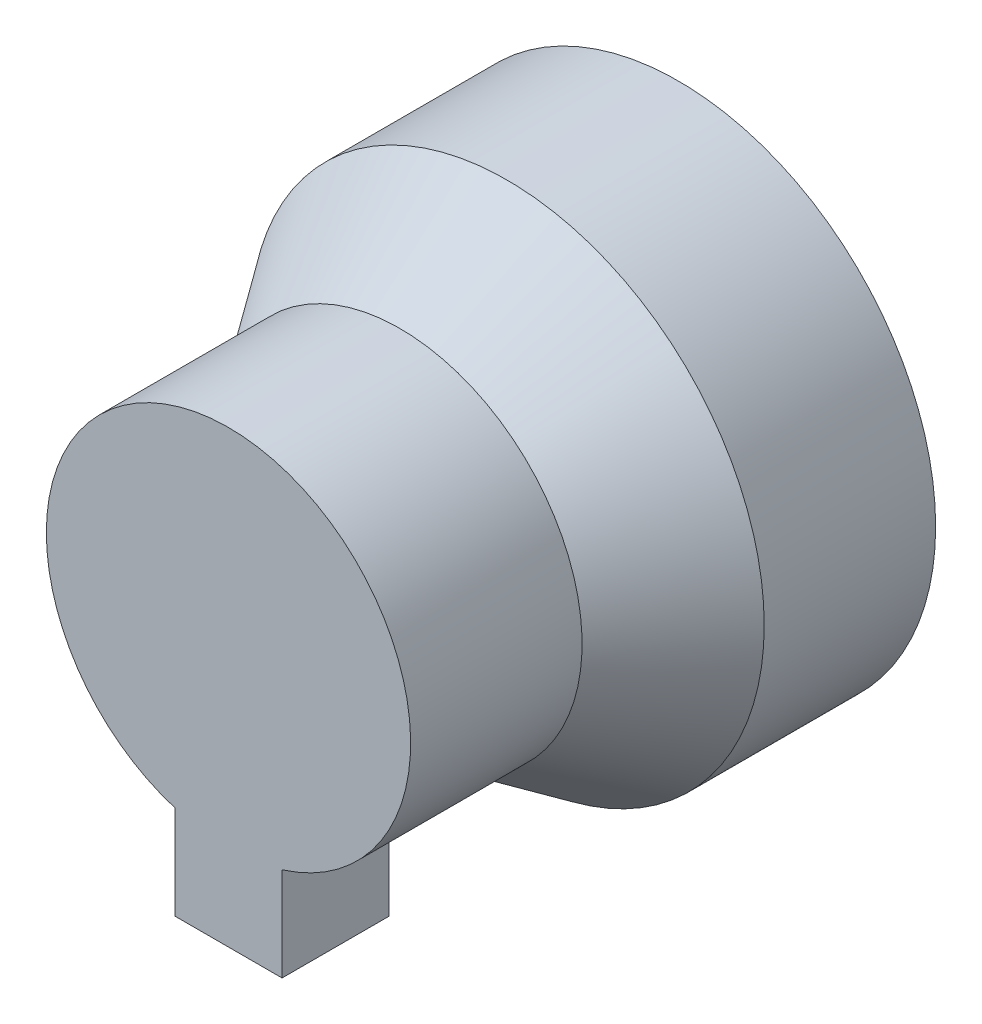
ISO-10303-21;
HEADER;
FILE_DESCRIPTION(('STEP AP214'),'2;1');
FILE_NAME('part.step','',(''),(''),'','','');
FILE_SCHEMA(('AUTOMOTIVE_DESIGN { 1 0 10303 214 1 1 1 1 }'));
ENDSEC;
DATA;
#1=APPLICATION_CONTEXT('core data for automotive mechanical design processes');
#2=APPLICATION_PROTOCOL_DEFINITION('international standard','automotive_design',2000,#1);
#3=PRODUCT_CONTEXT('',#1,'mechanical');
#4=PRODUCT('Part','Part','',(#3));
#5=PRODUCT_RELATED_PRODUCT_CATEGORY('part','',(#4));
#6=PRODUCT_DEFINITION_FORMATION('','',#4);
#7=PRODUCT_DEFINITION_CONTEXT('part definition',#1,'design');
#8=PRODUCT_DEFINITION('design','',#6,#7);
#9=PRODUCT_DEFINITION_SHAPE('','',#8);
#10=(LENGTH_UNIT() NAMED_UNIT(*) SI_UNIT(.MILLI.,.METRE.));
#11=(NAMED_UNIT(*) PLANE_ANGLE_UNIT() SI_UNIT($,.RADIAN.));
#12=(NAMED_UNIT(*) SI_UNIT($,.STERADIAN.) SOLID_ANGLE_UNIT());
#13=UNCERTAINTY_MEASURE_WITH_UNIT(LENGTH_MEASURE(1.E-05),#10,'distance_accuracy_value','');
#14=(GEOMETRIC_REPRESENTATION_CONTEXT(3) GLOBAL_UNCERTAINTY_ASSIGNED_CONTEXT((#13)) GLOBAL_UNIT_ASSIGNED_CONTEXT((#10,
#11,#12)) REPRESENTATION_CONTEXT('',''));
#15=CARTESIAN_POINT('',(0.,0.,0.));
#16=DIRECTION('',(0.,0.,1.));
#17=DIRECTION('',(1.,0.,0.));
#18=AXIS2_PLACEMENT_3D('',#15,#16,#17);
#19=CARTESIAN_POINT('',(0.,0.,0.));
#20=DIRECTION('',(0.,0.,-1.));
#21=DIRECTION('',(-1.,0.,0.));
#22=AXIS2_PLACEMENT_3D('',#19,#20,#21);
#23=CYLINDRICAL_SURFACE('',#22,8.5);
#24=CARTESIAN_POINT('',(0.,0.,13.));
#25=DIRECTION('',(0.,0.,-1.));
#26=DIRECTION('',(-1.,0.,0.));
#27=AXIS2_PLACEMENT_3D('',#24,#25,#26);
#28=CIRCLE('',#27,8.5);
#29=CARTESIAN_POINT('',(-8.5,0.,13.));
#30=VERTEX_POINT('',#29);
#31=EDGE_CURVE('E167',#30,#30,#28,.T.);
#32=ORIENTED_EDGE('',*,*,#31,.F.);
#33=EDGE_LOOP('',(#32));
#34=FACE_BOUND('',#33,.T.);
#35=CARTESIAN_POINT('',(0.,0.,16.));
#36=DIRECTION('',(0.,0.,1.));
#37=DIRECTION('',(1.,0.,0.));
#38=AXIS2_PLACEMENT_3D('',#35,#36,#37);
#39=CIRCLE('',#38,8.5);
#40=CARTESIAN_POINT('',(2.5,-8.12403840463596,16.));
#41=VERTEX_POINT('',#40);
#42=CARTESIAN_POINT('',(-2.5,-8.12403840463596,16.));
#43=VERTEX_POINT('',#42);
#44=EDGE_CURVE('E42',#41,#43,#39,.F.);
#45=ORIENTED_EDGE('',*,*,#44,.T.);
#46=DIRECTION('',(0.,0.,-1.));
#47=VECTOR('',#46,1.);
#48=CARTESIAN_POINT('',(-2.5,-8.12403840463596,0.));
#49=LINE('',#48,#47);
#50=CARTESIAN_POINT('',(-2.5,-8.12403840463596,21.));
#51=VERTEX_POINT('',#50);
#52=EDGE_CURVE('E11',#43,#51,#49,.F.);
#53=ORIENTED_EDGE('',*,*,#52,.T.);
#54=CARTESIAN_POINT('',(0.,0.,21.));
#55=DIRECTION('',(0.,0.,-1.));
#56=DIRECTION('',(-1.,0.,0.));
#57=AXIS2_PLACEMENT_3D('',#54,#55,#56);
#58=CIRCLE('',#57,8.5);
#59=CARTESIAN_POINT('',(2.5,-8.12403840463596,21.));
#60=VERTEX_POINT('',#59);
#61=EDGE_CURVE('E170',#51,#60,#58,.T.);
#62=ORIENTED_EDGE('',*,*,#61,.T.);
#63=DIRECTION('',(0.,0.,-1.));
#64=VECTOR('',#63,1.);
#65=CARTESIAN_POINT('',(2.5,-8.12403840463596,0.));
#66=LINE('',#65,#64);
#67=EDGE_CURVE('E172',#41,#60,#66,.F.);
#68=ORIENTED_EDGE('',*,*,#67,.F.);
#69=EDGE_LOOP('',(#45,#53,#62,#68));
#70=FACE_BOUND('',#69,.T.);
#71=ADVANCED_FACE('F34',(#34,#70),#23,.T.);
#72=CARTESIAN_POINT('',(0.,0.,21.));
#73=DIRECTION('',(0.,0.,1.));
#74=DIRECTION('',(1.,0.,0.));
#75=AXIS2_PLACEMENT_3D('',#72,#73,#74);
#76=PLANE('',#75);
#77=ORIENTED_EDGE('',*,*,#61,.F.);
#78=DIRECTION('',(0.,-1.,0.));
#79=VECTOR('',#78,1.);
#80=CARTESIAN_POINT('',(-2.5,-2.5,21.));
#81=LINE('',#80,#79);
#82=CARTESIAN_POINT('',(-2.5,-12.5,21.));
#83=VERTEX_POINT('',#82);
#84=EDGE_CURVE('E157',#51,#83,#81,.T.);
#85=ORIENTED_EDGE('',*,*,#84,.T.);
#86=DIRECTION('',(-1.,0.,0.));
#87=VECTOR('',#86,1.);
#88=CARTESIAN_POINT('',(2.5,-12.5,21.));
#89=LINE('',#88,#87);
#90=CARTESIAN_POINT('',(2.5,-12.5,21.));
#91=VERTEX_POINT('',#90);
#92=EDGE_CURVE('E147',#91,#83,#89,.T.);
#93=ORIENTED_EDGE('',*,*,#92,.F.);
#94=DIRECTION('',(0.,-1.,0.));
#95=VECTOR('',#94,1.);
#96=CARTESIAN_POINT('',(2.5,-2.5,21.));
#97=LINE('',#96,#95);
#98=EDGE_CURVE('E155',#60,#91,#97,.T.);
#99=ORIENTED_EDGE('',*,*,#98,.F.);
#100=EDGE_LOOP('',(#77,#85,#93,#99));
#101=FACE_BOUND('',#100,.T.);
#102=ADVANCED_FACE('F36',(#101),#76,.T.);
#103=CARTESIAN_POINT('',(0.,0.,8.));
#104=DIRECTION('',(0.,0.,-1.));
#105=DIRECTION('',(-1.,0.,0.));
#106=AXIS2_PLACEMENT_3D('',#103,#104,#105);
#107=CONICAL_SURFACE('',#106,12.,0.610725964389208);
#108=ORIENTED_EDGE('',*,*,#31,.T.);
#109=EDGE_LOOP('',(#108));
#110=FACE_BOUND('',#109,.T.);
#111=CARTESIAN_POINT('',(0.,0.,8.));
#112=DIRECTION('',(0.,0.,-1.));
#113=DIRECTION('',(-1.,0.,0.));
#114=AXIS2_PLACEMENT_3D('',#111,#112,#113);
#115=CIRCLE('',#114,12.);
#116=CARTESIAN_POINT('',(-12.,0.,8.));
#117=VERTEX_POINT('',#116);
#118=EDGE_CURVE('E164',#117,#117,#115,.T.);
#119=ORIENTED_EDGE('',*,*,#118,.F.);
#120=EDGE_LOOP('',(#119));
#121=FACE_BOUND('',#120,.T.);
#122=ADVANCED_FACE('F197',(#110,#121),#107,.T.);
#123=CARTESIAN_POINT('',(0.,0.,0.));
#124=DIRECTION('',(0.,0.,-1.));
#125=DIRECTION('',(-1.,0.,0.));
#126=AXIS2_PLACEMENT_3D('',#123,#124,#125);
#127=CYLINDRICAL_SURFACE('',#126,12.);
#128=ORIENTED_EDGE('',*,*,#118,.T.);
#129=EDGE_LOOP('',(#128));
#130=FACE_BOUND('',#129,.T.);
#131=CARTESIAN_POINT('',(0.,0.,0.));
#132=DIRECTION('',(0.,0.,-1.));
#133=DIRECTION('',(-1.,0.,0.));
#134=AXIS2_PLACEMENT_3D('',#131,#132,#133);
#135=CIRCLE('',#134,12.);
#136=CARTESIAN_POINT('',(-12.,0.,0.));
#137=VERTEX_POINT('',#136);
#138=EDGE_CURVE('E161',#137,#137,#135,.T.);
#139=ORIENTED_EDGE('',*,*,#138,.F.);
#140=EDGE_LOOP('',(#139));
#141=FACE_BOUND('',#140,.T.);
#142=ADVANCED_FACE('F202',(#130,#141),#127,.T.);
#143=CARTESIAN_POINT('',(0.,0.,0.));
#144=DIRECTION('',(0.,0.,-1.));
#145=DIRECTION('',(-1.,0.,0.));
#146=AXIS2_PLACEMENT_3D('',#143,#144,#145);
#147=PLANE('',#146);
#148=CARTESIAN_POINT('',(0.,0.,0.));
#149=DIRECTION('',(0.,0.,-1.));
#150=DIRECTION('',(-1.,0.,0.));
#151=AXIS2_PLACEMENT_3D('',#148,#149,#150);
#152=CIRCLE('',#151,11.5);
#153=CARTESIAN_POINT('',(-11.5,0.,0.));
#154=VERTEX_POINT('',#153);
#155=EDGE_CURVE('E121',#154,#154,#152,.T.);
#156=ORIENTED_EDGE('',*,*,#155,.F.);
#157=EDGE_LOOP('',(#156));
#158=FACE_BOUND('',#157,.T.);
#159=ORIENTED_EDGE('',*,*,#138,.T.);
#160=EDGE_LOOP('',(#159));
#161=FACE_BOUND('',#160,.T.);
#162=ADVANCED_FACE('F206',(#158,#161),#147,.T.);
#163=CARTESIAN_POINT('',(2.5,-2.5,16.));
#164=DIRECTION('',(0.,0.,1.));
#165=DIRECTION('',(1.,0.,0.));
#166=AXIS2_PLACEMENT_3D('',#163,#164,#165);
#167=PLANE('',#166);
#168=ORIENTED_EDGE('',*,*,#44,.F.);
#169=DIRECTION('',(0.,-1.,0.));
#170=VECTOR('',#169,1.);
#171=CARTESIAN_POINT('',(2.5,-2.5,16.));
#172=LINE('',#171,#170);
#173=CARTESIAN_POINT('',(2.5,-12.5,16.));
#174=VERTEX_POINT('',#173);
#175=EDGE_CURVE('E153',#41,#174,#172,.T.);
#176=ORIENTED_EDGE('',*,*,#175,.T.);
#177=DIRECTION('',(-1.,0.,0.));
#178=VECTOR('',#177,1.);
#179=CARTESIAN_POINT('',(2.5,-12.5,16.));
#180=LINE('',#179,#178);
#181=CARTESIAN_POINT('',(-2.5,-12.5,16.));
#182=VERTEX_POINT('',#181);
#183=EDGE_CURVE('E115',#174,#182,#180,.T.);
#184=ORIENTED_EDGE('',*,*,#183,.T.);
#185=DIRECTION('',(0.,-1.,0.));
#186=VECTOR('',#185,1.);
#187=CARTESIAN_POINT('',(-2.5,-2.5,16.));
#188=LINE('',#187,#186);
#189=EDGE_CURVE('E159',#43,#182,#188,.T.);
#190=ORIENTED_EDGE('',*,*,#189,.F.);
#191=EDGE_LOOP('',(#168,#176,#184,#190));
#192=FACE_BOUND('',#191,.T.);
#193=ADVANCED_FACE('F189',(#192),#167,.F.);
#194=CARTESIAN_POINT('',(-2.5,-2.5,16.));
#195=DIRECTION('',(1.,0.,0.));
#196=DIRECTION('',(0.,0.,-1.));
#197=AXIS2_PLACEMENT_3D('',#194,#195,#196);
#198=PLANE('',#197);
#199=ORIENTED_EDGE('',*,*,#52,.F.);
#200=ORIENTED_EDGE('',*,*,#189,.T.);
#201=DIRECTION('',(0.,0.,1.));
#202=VECTOR('',#201,1.);
#203=CARTESIAN_POINT('',(-2.5,-12.5,16.));
#204=LINE('',#203,#202);
#205=EDGE_CURVE('E144',#182,#83,#204,.T.);
#206=ORIENTED_EDGE('',*,*,#205,.T.);
#207=ORIENTED_EDGE('',*,*,#84,.F.);
#208=EDGE_LOOP('',(#199,#200,#206,#207));
#209=FACE_BOUND('',#208,.T.);
#210=ADVANCED_FACE('F191',(#209),#198,.F.);
#211=CARTESIAN_POINT('',(2.5,-2.5,16.));
#212=DIRECTION('',(1.,0.,0.));
#213=DIRECTION('',(0.,0.,-1.));
#214=AXIS2_PLACEMENT_3D('',#211,#212,#213);
#215=PLANE('',#214);
#216=ORIENTED_EDGE('',*,*,#175,.F.);
#217=ORIENTED_EDGE('',*,*,#67,.T.);
#218=ORIENTED_EDGE('',*,*,#98,.T.);
#219=DIRECTION('',(0.,0.,1.));
#220=VECTOR('',#219,1.);
#221=CARTESIAN_POINT('',(2.5,-12.5,16.));
#222=LINE('',#221,#220);
#223=EDGE_CURVE('E150',#174,#91,#222,.T.);
#224=ORIENTED_EDGE('',*,*,#223,.F.);
#225=EDGE_LOOP('',(#216,#217,#218,#224));
#226=FACE_BOUND('',#225,.T.);
#227=ADVANCED_FACE('F177',(#226),#215,.T.);
#228=CARTESIAN_POINT('',(0.,-12.5,0.));
#229=DIRECTION('',(0.,1.,0.));
#230=DIRECTION('',(0.,0.,1.));
#231=AXIS2_PLACEMENT_3D('',#228,#229,#230);
#232=PLANE('',#231);
#233=DIRECTION('',(0.,0.,1.));
#234=VECTOR('',#233,1.);
#235=CARTESIAN_POINT('',(2.,-12.5,16.));
#236=LINE('',#235,#234);
#237=CARTESIAN_POINT('',(2.,-12.5,16.5));
#238=VERTEX_POINT('',#237);
#239=CARTESIAN_POINT('',(2.,-12.5,20.5));
#240=VERTEX_POINT('',#239);
#241=EDGE_CURVE('E132',#238,#240,#236,.T.);
#242=ORIENTED_EDGE('',*,*,#241,.F.);
#243=DIRECTION('',(-1.,0.,0.));
#244=VECTOR('',#243,1.);
#245=CARTESIAN_POINT('',(2.5,-12.5,16.5));
#246=LINE('',#245,#244);
#247=CARTESIAN_POINT('',(-2.,-12.5,16.5));
#248=VERTEX_POINT('',#247);
#249=EDGE_CURVE('E138',#238,#248,#246,.T.);
#250=ORIENTED_EDGE('',*,*,#249,.T.);
#251=DIRECTION('',(0.,0.,1.));
#252=VECTOR('',#251,1.);
#253=CARTESIAN_POINT('',(-2.,-12.5,16.));
#254=LINE('',#253,#252);
#255=CARTESIAN_POINT('',(-2.,-12.5,20.5));
#256=VERTEX_POINT('',#255);
#257=EDGE_CURVE('E119',#248,#256,#254,.T.);
#258=ORIENTED_EDGE('',*,*,#257,.T.);
#259=DIRECTION('',(-1.,0.,0.));
#260=VECTOR('',#259,1.);
#261=CARTESIAN_POINT('',(0.,-12.5,20.5));
#262=LINE('',#261,#260);
#263=EDGE_CURVE('E49',#240,#256,#262,.T.);
#264=ORIENTED_EDGE('',*,*,#263,.F.);
#265=EDGE_LOOP('',(#242,#250,#258,#264));
#266=FACE_BOUND('',#265,.T.);
#267=ORIENTED_EDGE('',*,*,#183,.F.);
#268=ORIENTED_EDGE('',*,*,#223,.T.);
#269=ORIENTED_EDGE('',*,*,#92,.T.);
#270=ORIENTED_EDGE('',*,*,#205,.F.);
#271=EDGE_LOOP('',(#267,#268,#269,#270));
#272=FACE_BOUND('',#271,.T.);
#273=ADVANCED_FACE('F186',(#266,#272),#232,.F.);
#274=CARTESIAN_POINT('',(0.,0.,0.));
#275=DIRECTION('',(0.,0.,-1.));
#276=DIRECTION('',(-1.,0.,0.));
#277=AXIS2_PLACEMENT_3D('',#274,#275,#276);
#278=CYLINDRICAL_SURFACE('',#277,8.);
#279=CARTESIAN_POINT('',(0.,0.,12.8423888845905));
#280=DIRECTION('',(0.,0.,-1.));
#281=DIRECTION('',(-1.,0.,0.));
#282=AXIS2_PLACEMENT_3D('',#279,#280,#281);
#283=CIRCLE('',#282,8.);
#284=CARTESIAN_POINT('',(-8.,0.,12.8423888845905));
#285=VERTEX_POINT('',#284);
#286=EDGE_CURVE('E135',#285,#285,#283,.T.);
#287=ORIENTED_EDGE('',*,*,#286,.T.);
#288=EDGE_LOOP('',(#287));
#289=FACE_BOUND('',#288,.T.);
#290=CARTESIAN_POINT('',(0.,0.,16.5));
#291=DIRECTION('',(0.,0.,1.));
#292=DIRECTION('',(1.,0.,0.));
#293=AXIS2_PLACEMENT_3D('',#290,#291,#292);
#294=CIRCLE('',#293,8.);
#295=CARTESIAN_POINT('',(2.,-7.74596669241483,16.5));
#296=VERTEX_POINT('',#295);
#297=CARTESIAN_POINT('',(-2.,-7.74596669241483,16.5));
#298=VERTEX_POINT('',#297);
#299=EDGE_CURVE('E98',#296,#298,#294,.F.);
#300=ORIENTED_EDGE('',*,*,#299,.F.);
#301=DIRECTION('',(0.,0.,-1.));
#302=VECTOR('',#301,1.);
#303=CARTESIAN_POINT('',(2.,-7.74596669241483,16.5));
#304=LINE('',#303,#302);
#305=CARTESIAN_POINT('',(2.,-7.74596669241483,20.5));
#306=VERTEX_POINT('',#305);
#307=EDGE_CURVE('E109',#296,#306,#304,.F.);
#308=ORIENTED_EDGE('',*,*,#307,.T.);
#309=CARTESIAN_POINT('',(0.,0.,20.5));
#310=DIRECTION('',(0.,0.,1.));
#311=DIRECTION('',(1.,0.,0.));
#312=AXIS2_PLACEMENT_3D('',#309,#310,#311);
#313=CIRCLE('',#312,8.);
#314=CARTESIAN_POINT('',(-2.,-7.74596669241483,20.5));
#315=VERTEX_POINT('',#314);
#316=EDGE_CURVE('E113',#315,#306,#313,.F.);
#317=ORIENTED_EDGE('',*,*,#316,.F.);
#318=DIRECTION('',(0.,0.,-1.));
#319=VECTOR('',#318,1.);
#320=CARTESIAN_POINT('',(-2.,-7.74596669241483,16.5));
#321=LINE('',#320,#319);
#322=EDGE_CURVE('E108',#298,#315,#321,.F.);
#323=ORIENTED_EDGE('',*,*,#322,.F.);
#324=EDGE_LOOP('',(#300,#308,#317,#323));
#325=FACE_BOUND('',#324,.T.);
#326=ADVANCED_FACE('F112',(#289,#325),#278,.F.);
#327=CARTESIAN_POINT('',(0.,0.,20.5));
#328=DIRECTION('',(0.,0.,1.));
#329=DIRECTION('',(1.,0.,0.));
#330=AXIS2_PLACEMENT_3D('',#327,#328,#329);
#331=PLANE('',#330);
#332=ORIENTED_EDGE('',*,*,#316,.T.);
#333=DIRECTION('',(0.,-1.,0.));
#334=VECTOR('',#333,1.);
#335=CARTESIAN_POINT('',(2.,-2.5,20.5));
#336=LINE('',#335,#334);
#337=EDGE_CURVE('E127',#306,#240,#336,.T.);
#338=ORIENTED_EDGE('',*,*,#337,.T.);
#339=ORIENTED_EDGE('',*,*,#263,.T.);
#340=DIRECTION('',(0.,-1.,0.));
#341=VECTOR('',#340,1.);
#342=CARTESIAN_POINT('',(-2.,-2.5,20.5));
#343=LINE('',#342,#341);
#344=EDGE_CURVE('E122',#315,#256,#343,.T.);
#345=ORIENTED_EDGE('',*,*,#344,.F.);
#346=EDGE_LOOP('',(#332,#338,#339,#345));
#347=FACE_BOUND('',#346,.T.);
#348=ADVANCED_FACE('F235',(#347),#331,.F.);
#349=CARTESIAN_POINT('',(0.,0.,7.71326882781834));
#350=DIRECTION('',(0.,0.,-1.));
#351=DIRECTION('',(-1.,0.,0.));
#352=AXIS2_PLACEMENT_3D('',#349,#350,#351);
#353=CONICAL_SURFACE('',#352,11.5903840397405,0.610725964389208);
#354=ORIENTED_EDGE('',*,*,#286,.F.);
#355=EDGE_LOOP('',(#354));
#356=FACE_BOUND('',#355,.T.);
#357=CARTESIAN_POINT('',(0.,0.,7.84238888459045));
#358=DIRECTION('',(0.,0.,-1.));
#359=DIRECTION('',(-1.,0.,0.));
#360=AXIS2_PLACEMENT_3D('',#357,#358,#359);
#361=CIRCLE('',#360,11.5);
#362=CARTESIAN_POINT('',(-11.5,0.,7.84238888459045));
#363=VERTEX_POINT('',#362);
#364=EDGE_CURVE('E125',#363,#363,#361,.T.);
#365=ORIENTED_EDGE('',*,*,#364,.T.);
#366=EDGE_LOOP('',(#365));
#367=FACE_BOUND('',#366,.T.);
#368=ADVANCED_FACE('F231',(#356,#367),#353,.F.);
#369=CARTESIAN_POINT('',(0.,0.,0.));
#370=DIRECTION('',(0.,0.,-1.));
#371=DIRECTION('',(-1.,0.,0.));
#372=AXIS2_PLACEMENT_3D('',#369,#370,#371);
#373=CYLINDRICAL_SURFACE('',#372,11.5);
#374=ORIENTED_EDGE('',*,*,#364,.F.);
#375=EDGE_LOOP('',(#374));
#376=FACE_BOUND('',#375,.T.);
#377=ORIENTED_EDGE('',*,*,#155,.T.);
#378=EDGE_LOOP('',(#377));
#379=FACE_BOUND('',#378,.T.);
#380=ADVANCED_FACE('F228',(#376,#379),#373,.F.);
#381=CARTESIAN_POINT('',(2.5,-2.5,16.5));
#382=DIRECTION('',(0.,0.,1.));
#383=DIRECTION('',(1.,0.,0.));
#384=AXIS2_PLACEMENT_3D('',#381,#382,#383);
#385=PLANE('',#384);
#386=ORIENTED_EDGE('',*,*,#299,.T.);
#387=DIRECTION('',(0.,-1.,0.));
#388=VECTOR('',#387,1.);
#389=CARTESIAN_POINT('',(-2.,-2.5,16.5));
#390=LINE('',#389,#388);
#391=EDGE_CURVE('E103',#298,#248,#390,.T.);
#392=ORIENTED_EDGE('',*,*,#391,.T.);
#393=ORIENTED_EDGE('',*,*,#249,.F.);
#394=DIRECTION('',(0.,-1.,0.));
#395=VECTOR('',#394,1.);
#396=CARTESIAN_POINT('',(2.,-2.5,16.5));
#397=LINE('',#396,#395);
#398=EDGE_CURVE('E105',#296,#238,#397,.T.);
#399=ORIENTED_EDGE('',*,*,#398,.F.);
#400=EDGE_LOOP('',(#386,#392,#393,#399));
#401=FACE_BOUND('',#400,.T.);
#402=ADVANCED_FACE('F100',(#401),#385,.T.);
#403=CARTESIAN_POINT('',(-2.,-2.5,16.));
#404=DIRECTION('',(1.,0.,0.));
#405=DIRECTION('',(0.,0.,-1.));
#406=AXIS2_PLACEMENT_3D('',#403,#404,#405);
#407=PLANE('',#406);
#408=ORIENTED_EDGE('',*,*,#322,.T.);
#409=ORIENTED_EDGE('',*,*,#344,.T.);
#410=ORIENTED_EDGE('',*,*,#257,.F.);
#411=ORIENTED_EDGE('',*,*,#391,.F.);
#412=EDGE_LOOP('',(#408,#409,#410,#411));
#413=FACE_BOUND('',#412,.T.);
#414=ADVANCED_FACE('F117',(#413),#407,.T.);
#415=CARTESIAN_POINT('',(2.,-2.5,16.));
#416=DIRECTION('',(1.,0.,0.));
#417=DIRECTION('',(0.,0.,-1.));
#418=AXIS2_PLACEMENT_3D('',#415,#416,#417);
#419=PLANE('',#418);
#420=ORIENTED_EDGE('',*,*,#398,.T.);
#421=ORIENTED_EDGE('',*,*,#241,.T.);
#422=ORIENTED_EDGE('',*,*,#337,.F.);
#423=ORIENTED_EDGE('',*,*,#307,.F.);
#424=EDGE_LOOP('',(#420,#421,#422,#423));
#425=FACE_BOUND('',#424,.T.);
#426=ADVANCED_FACE('F220',(#425),#419,.F.);
#427=CLOSED_SHELL('',(#71,#102,#122,#142,#162,#193,#210,#227,#273,#326,#348,#368,#380,#402,#414,#426));
#428=MANIFOLD_SOLID_BREP('B2',#427);
#429=ADVANCED_BREP_SHAPE_REPRESENTATION('',(#18,#428),#14);
#430=SHAPE_DEFINITION_REPRESENTATION(#9,#429);
ENDSEC;
END-ISO-10303-21;
